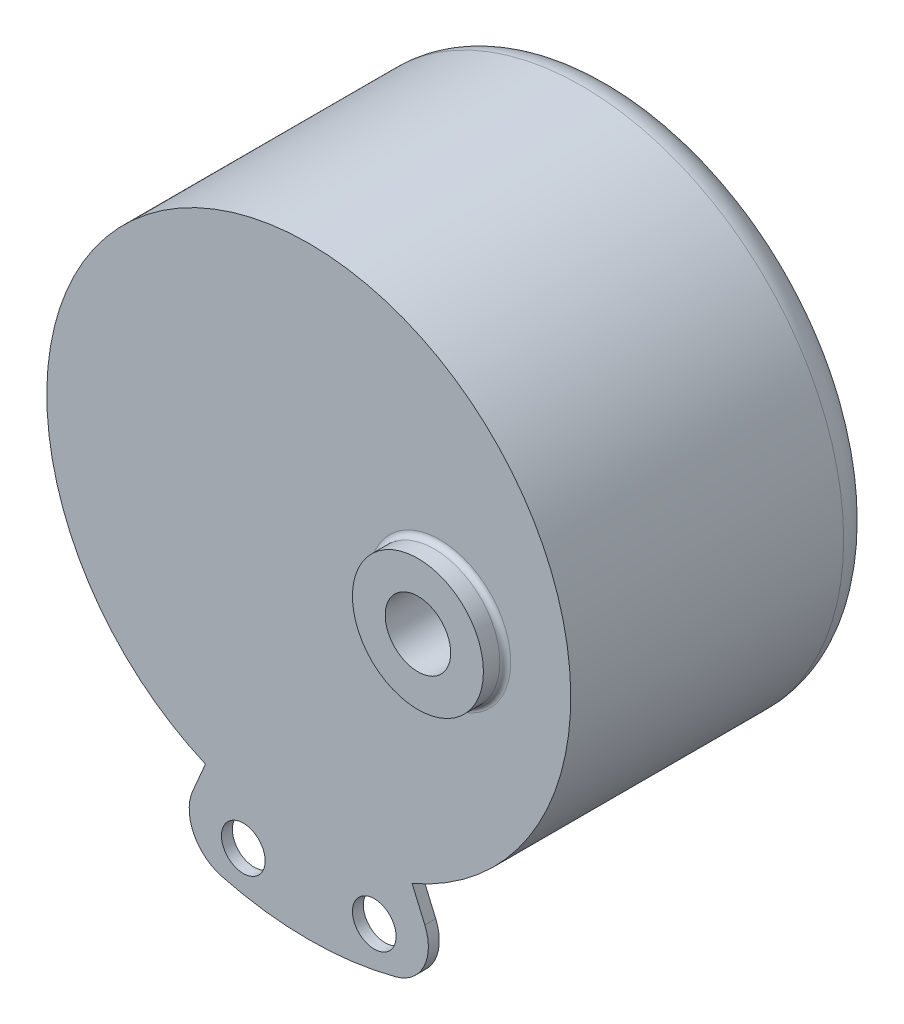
from build123d import *

# Parameters (mm, degrees)
ESQUISSE1_R             = 24
BOSS_EXTRU_1_DEPTH      = 28
ESQUISSE2_R             = 6
BOSS_EXTRU_2_DEPTH      = 2
CONG_1_R                = 3
CONG_2_R                = 0.5
ESQUISSE3_R             = 3
ENL_V_MAT_EXTRU_1_DEPTH = 10
BOSS_EXTRU_3_START      = -1
ESQUISSE4_R             = 2
BOSS_EXTRU_3_DEPTH      = 1


with BuildPart() as part:
    # Esquisse1 → Boss.-Extru.1 (new body)
    with BuildSketch(Plane.XY):
        Circle(ESQUISSE1_R)
    extrude(amount=BOSS_EXTRU_1_DEPTH)

    # Esquisse2 → Boss.-Extru.2 (add)
    with BuildSketch(Plane.XY.offset(28)):
        with Locations((12, 0)):
            Circle(ESQUISSE2_R)
    extrude(amount=BOSS_EXTRU_2_DEPTH)

    # Cong_1
    cong_1_edges = [part.edges().sort_by_distance(p)[0] for p in [
        (-24, 0, 0),
    ]]
    fillet(cong_1_edges, radius=CONG_1_R)

    # Cong_2
    cong_2_edges = [part.edges().sort_by_distance(p)[0] for p in [
        (6, 0, 28),
    ]]
    fillet(cong_2_edges, radius=CONG_2_R)

    # Esquisse3 → Enl_v. mat.-Extru.1 (cut)
    with BuildSketch(Plane.XY.offset(30)):
        with Locations((12, 0)):
            Circle(ESQUISSE3_R)
    extrude(amount=-ENL_V_MAT_EXTRU_1_DEPTH, mode=Mode.SUBTRACT)

    # Esquisse4 → Boss.-Extru.3 (add)
    with BuildSketch(Plane.XY.offset(28).offset(BOSS_EXTRU_3_START)):
        with BuildLine():
            Line((9.466588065, -22.054108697), (10.63080391, -24.766357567))
            ThreePointArc((10.63080391, -24.766357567), (10.550606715, -28.096968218), (7.976175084, -30.211607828))
            ThreePointArc((7.976175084, -30.211607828), (0, -31.246769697), (-7.976175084, -30.211607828))
            ThreePointArc((-7.976175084, -30.211607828), (-10.550606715, -28.096968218), (-10.63080391, -24.766357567))
            Line((-10.63080391, -24.766357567), (-9.466588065, -22.054108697))
            ThreePointArc((-9.466588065, -22.054108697), (0, -24), (9.466588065, -22.054108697))
        make_face()
        with Locations((6, -27)):
            Circle(ESQUISSE4_R, mode=Mode.SUBTRACT)
        with Locations(Location((-6, -27, 0), (0, 0, 180))):
            Circle(ESQUISSE4_R, mode=Mode.SUBTRACT)
    extrude(amount=BOSS_EXTRU_3_DEPTH)


solid = part.part
